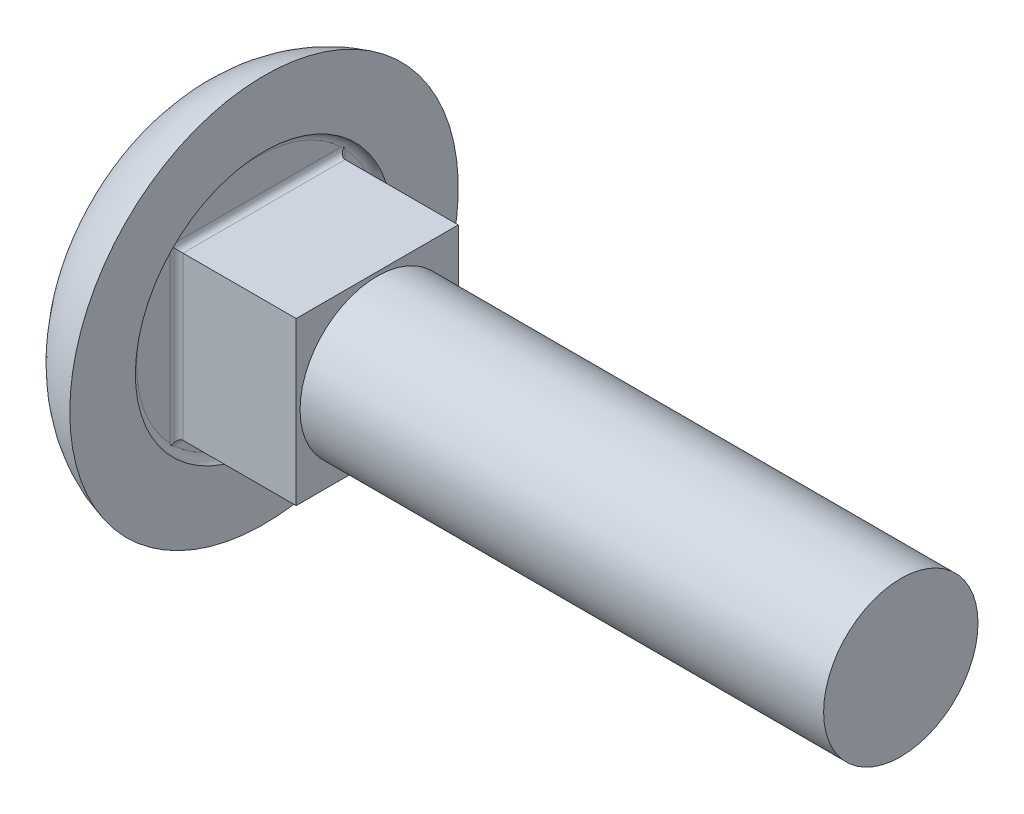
ISO-10303-21;
HEADER;
FILE_DESCRIPTION(('STEP AP214'),'2;1');
FILE_NAME('part.step','',(''),(''),'','','');
FILE_SCHEMA(('AUTOMOTIVE_DESIGN { 1 0 10303 214 1 1 1 1 }'));
ENDSEC;
DATA;
#1=APPLICATION_CONTEXT('core data for automotive mechanical design processes');
#2=APPLICATION_PROTOCOL_DEFINITION('international standard','automotive_design',2000,#1);
#3=PRODUCT_CONTEXT('',#1,'mechanical');
#4=PRODUCT('Part','Part','',(#3));
#5=PRODUCT_RELATED_PRODUCT_CATEGORY('part','',(#4));
#6=PRODUCT_DEFINITION_FORMATION('','',#4);
#7=PRODUCT_DEFINITION_CONTEXT('part definition',#1,'design');
#8=PRODUCT_DEFINITION('design','',#6,#7);
#9=PRODUCT_DEFINITION_SHAPE('','',#8);
#10=(LENGTH_UNIT() NAMED_UNIT(*) SI_UNIT(.MILLI.,.METRE.));
#11=(NAMED_UNIT(*) PLANE_ANGLE_UNIT() SI_UNIT($,.RADIAN.));
#12=(NAMED_UNIT(*) SI_UNIT($,.STERADIAN.) SOLID_ANGLE_UNIT());
#13=UNCERTAINTY_MEASURE_WITH_UNIT(LENGTH_MEASURE(1.E-05),#10,'distance_accuracy_value','');
#14=(GEOMETRIC_REPRESENTATION_CONTEXT(3) GLOBAL_UNCERTAINTY_ASSIGNED_CONTEXT((#13)) GLOBAL_UNIT_ASSIGNED_CONTEXT((#10,
#11,#12)) REPRESENTATION_CONTEXT('',''));
#15=CARTESIAN_POINT('',(0.,0.,0.));
#16=DIRECTION('',(0.,0.,1.));
#17=DIRECTION('',(1.,0.,0.));
#18=AXIS2_PLACEMENT_3D('',#15,#16,#17);
#19=CARTESIAN_POINT('',(3.73,0.,0.));
#20=DIRECTION('',(1.,0.,0.));
#21=DIRECTION('',(0.,0.,-1.));
#22=AXIS2_PLACEMENT_3D('',#19,#20,#21);
#23=PLANE('',#22);
#24=DIRECTION('',(0.,0.,-1.));
#25=VECTOR('',#24,1.);
#26=CARTESIAN_POINT('',(3.73,3.4,-3.15));
#27=LINE('',#26,#25);
#28=CARTESIAN_POINT('',(3.73,3.4,3.2510706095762));
#29=VERTEX_POINT('',#28);
#30=CARTESIAN_POINT('',(3.73,3.4,-3.2510706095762));
#31=VERTEX_POINT('',#30);
#32=EDGE_CURVE('E172',#29,#31,#27,.T.);
#33=ORIENTED_EDGE('',*,*,#32,.T.);
#34=CARTESIAN_POINT('',(3.73,0.,0.));
#35=DIRECTION('',(1.,0.,0.));
#36=DIRECTION('',(0.,0.,-1.));
#37=AXIS2_PLACEMENT_3D('',#34,#35,#36);
#38=CIRCLE('',#37,4.70419601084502);
#39=EDGE_CURVE('E204',#31,#29,#38,.T.);
#40=ORIENTED_EDGE('',*,*,#39,.T.);
#41=EDGE_LOOP('',(#33,#40));
#42=FACE_BOUND('',#41,.T.);
#43=ADVANCED_FACE('F36',(#42),#23,.T.);
#44=DIRECTION('',(0.,1.,0.));
#45=VECTOR('',#44,1.);
#46=CARTESIAN_POINT('',(3.73,3.15,3.4));
#47=LINE('',#46,#45);
#48=CARTESIAN_POINT('',(3.73,-3.2510706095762,3.4));
#49=VERTEX_POINT('',#48);
#50=CARTESIAN_POINT('',(3.73,3.2510706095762,3.4));
#51=VERTEX_POINT('',#50);
#52=EDGE_CURVE('E175',#49,#51,#47,.T.);
#53=ORIENTED_EDGE('',*,*,#52,.T.);
#54=CARTESIAN_POINT('',(3.73,0.,0.));
#55=DIRECTION('',(1.,0.,0.));
#56=DIRECTION('',(0.,0.,-1.));
#57=AXIS2_PLACEMENT_3D('',#54,#55,#56);
#58=CIRCLE('',#57,4.70419601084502);
#59=EDGE_CURVE('E202',#51,#49,#58,.T.);
#60=ORIENTED_EDGE('',*,*,#59,.T.);
#61=EDGE_LOOP('',(#53,#60));
#62=FACE_BOUND('',#61,.T.);
#63=ADVANCED_FACE('F293',(#62),#23,.T.);
#64=DIRECTION('',(0.,0.,1.));
#65=VECTOR('',#64,1.);
#66=CARTESIAN_POINT('',(3.73,-3.4,3.15));
#67=LINE('',#66,#65);
#68=CARTESIAN_POINT('',(3.73,-3.4,-3.2510706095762));
#69=VERTEX_POINT('',#68);
#70=CARTESIAN_POINT('',(3.73,-3.4,3.2510706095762));
#71=VERTEX_POINT('',#70);
#72=EDGE_CURVE('E178',#69,#71,#67,.T.);
#73=ORIENTED_EDGE('',*,*,#72,.T.);
#74=CARTESIAN_POINT('',(3.73,0.,0.));
#75=DIRECTION('',(1.,0.,0.));
#76=DIRECTION('',(0.,0.,-1.));
#77=AXIS2_PLACEMENT_3D('',#74,#75,#76);
#78=CIRCLE('',#77,4.70419601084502);
#79=EDGE_CURVE('E200',#71,#69,#78,.T.);
#80=ORIENTED_EDGE('',*,*,#79,.T.);
#81=EDGE_LOOP('',(#73,#80));
#82=FACE_BOUND('',#81,.T.);
#83=ADVANCED_FACE('F267',(#82),#23,.T.);
#84=CARTESIAN_POINT('',(8.38,-3.15,3.15));
#85=DIRECTION('',(-1.,0.,0.));
#86=DIRECTION('',(0.,0.,1.));
#87=AXIS2_PLACEMENT_3D('',#84,#85,#86);
#88=PLANE('',#87);
#89=DIRECTION('',(0.,0.,-1.));
#90=VECTOR('',#89,1.);
#91=CARTESIAN_POINT('',(8.38,-3.15,3.15));
#92=LINE('',#91,#90);
#93=CARTESIAN_POINT('',(8.38,-3.15,3.15));
#94=VERTEX_POINT('',#93);
#95=CARTESIAN_POINT('',(8.38,-3.15,-3.15));
#96=VERTEX_POINT('',#95);
#97=EDGE_CURVE('E126',#94,#96,#92,.T.);
#98=ORIENTED_EDGE('',*,*,#97,.T.);
#99=DIRECTION('',(0.,1.,0.));
#100=VECTOR('',#99,1.);
#101=CARTESIAN_POINT('',(8.38,-3.15,-3.15));
#102=LINE('',#101,#100);
#103=CARTESIAN_POINT('',(8.38,3.15,-3.15));
#104=VERTEX_POINT('',#103);
#105=EDGE_CURVE('E135',#96,#104,#102,.T.);
#106=ORIENTED_EDGE('',*,*,#105,.T.);
#107=DIRECTION('',(0.,0.,1.));
#108=VECTOR('',#107,1.);
#109=CARTESIAN_POINT('',(8.38,3.15,-3.15));
#110=LINE('',#109,#108);
#111=CARTESIAN_POINT('',(8.38,3.15,3.15));
#112=VERTEX_POINT('',#111);
#113=EDGE_CURVE('E141',#104,#112,#110,.T.);
#114=ORIENTED_EDGE('',*,*,#113,.T.);
#115=DIRECTION('',(0.,-1.,0.));
#116=VECTOR('',#115,1.);
#117=CARTESIAN_POINT('',(8.38,3.15,3.15));
#118=LINE('',#117,#116);
#119=EDGE_CURVE('E147',#112,#94,#118,.T.);
#120=ORIENTED_EDGE('',*,*,#119,.T.);
#121=EDGE_LOOP('',(#98,#106,#114,#120));
#122=FACE_BOUND('',#121,.T.);
#123=CARTESIAN_POINT('',(8.38,0.,0.));
#124=DIRECTION('',(-1.,0.,0.));
#125=DIRECTION('',(0.,0.,1.));
#126=AXIS2_PLACEMENT_3D('',#123,#124,#125);
#127=CIRCLE('',#126,3.);
#128=CARTESIAN_POINT('',(8.38,0.,3.));
#129=VERTEX_POINT('',#128);
#130=EDGE_CURVE('E188',#129,#129,#127,.F.);
#131=ORIENTED_EDGE('',*,*,#130,.F.);
#132=EDGE_LOOP('',(#131));
#133=FACE_BOUND('',#132,.T.);
#134=ADVANCED_FACE('F144',(#122,#133),#88,.F.);
#135=CARTESIAN_POINT('',(5.04748806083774,0.,0.));
#136=DIRECTION('',(-1.,0.,0.));
#137=DIRECTION('',(0.,0.,1.));
#138=AXIS2_PLACEMENT_3D('',#135,#136,#137);
#139=DEGENERATE_TOROIDAL_SURFACE('',#138,3.17844773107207,4.5,.T.);
#140=CARTESIAN_POINT('',(0.806824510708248,0.,0.));
#141=DIRECTION('',(-1.,0.,0.));
#142=DIRECTION('',(0.,0.,1.));
#143=AXIS2_PLACEMENT_3D('',#140,#141,#142);
#144=CIRCLE('',#143,4.68402823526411);
#145=CARTESIAN_POINT('',(0.806824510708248,0.,4.68402823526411));
#146=VERTEX_POINT('',#145);
#147=EDGE_CURVE('E163',#146,#146,#144,.T.);
#148=ORIENTED_EDGE('',*,*,#147,.F.);
#149=EDGE_LOOP('',(#148));
#150=FACE_BOUND('',#149,.T.);
#151=CARTESIAN_POINT('',(3.98,0.,0.));
#152=DIRECTION('',(-1.,0.,0.));
#153=DIRECTION('',(0.,0.,1.));
#154=AXIS2_PLACEMENT_3D('',#151,#152,#153);
#155=CIRCLE('',#154,7.55);
#156=CARTESIAN_POINT('',(3.98,0.,7.55));
#157=VERTEX_POINT('',#156);
#158=EDGE_CURVE('E166',#157,#157,#155,.T.);
#159=ORIENTED_EDGE('',*,*,#158,.T.);
#160=EDGE_LOOP('',(#159));
#161=FACE_BOUND('',#160,.T.);
#162=ADVANCED_FACE('F250',(#150,#161),#139,.T.);
#163=CARTESIAN_POINT('',(3.98,7.55,0.));
#164=DIRECTION('',(-1.,0.,0.));
#165=DIRECTION('',(0.,0.,1.));
#166=AXIS2_PLACEMENT_3D('',#163,#164,#165);
#167=PLANE('',#166);
#168=CARTESIAN_POINT('',(3.98,0.,0.));
#169=DIRECTION('',(1.,0.,0.));
#170=DIRECTION('',(0.,0.,-1.));
#171=AXIS2_PLACEMENT_3D('',#168,#169,#170);
#172=CIRCLE('',#171,5.);
#173=CARTESIAN_POINT('',(3.98,0.,-5.));
#174=VERTEX_POINT('',#173);
#175=EDGE_CURVE('E131',#174,#174,#172,.T.);
#176=ORIENTED_EDGE('',*,*,#175,.F.);
#177=EDGE_LOOP('',(#176));
#178=FACE_BOUND('',#177,.T.);
#179=ORIENTED_EDGE('',*,*,#158,.F.);
#180=EDGE_LOOP('',(#179));
#181=FACE_BOUND('',#180,.T.);
#182=ADVANCED_FACE('F254',(#178,#181),#167,.F.);
#183=CARTESIAN_POINT('',(14.,0.,0.));
#184=DIRECTION('',(-1.,0.,0.));
#185=DIRECTION('',(0.,1.,0.));
#186=AXIS2_PLACEMENT_3D('',#183,#184,#185);
#187=SPHERICAL_SURFACE('',#186,14.);
#188=ORIENTED_EDGE('',*,*,#147,.T.);
#189=EDGE_LOOP('',(#188));
#190=FACE_BOUND('',#189,.T.);
#191=ADVANCED_FACE('F258',(#190),#187,.T.);
#192=DIRECTION('',(0.,-1.,0.));
#193=VECTOR('',#192,1.);
#194=CARTESIAN_POINT('',(3.73,-3.15,-3.4));
#195=LINE('',#194,#193);
#196=CARTESIAN_POINT('',(3.73,3.2510706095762,-3.4));
#197=VERTEX_POINT('',#196);
#198=CARTESIAN_POINT('',(3.73,-3.2510706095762,-3.4));
#199=VERTEX_POINT('',#198);
#200=EDGE_CURVE('E169',#197,#199,#195,.T.);
#201=ORIENTED_EDGE('',*,*,#200,.T.);
#202=CARTESIAN_POINT('',(3.73,0.,0.));
#203=DIRECTION('',(1.,0.,0.));
#204=DIRECTION('',(0.,0.,-1.));
#205=AXIS2_PLACEMENT_3D('',#202,#203,#204);
#206=CIRCLE('',#205,4.70419601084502);
#207=EDGE_CURVE('E198',#199,#197,#206,.T.);
#208=ORIENTED_EDGE('',*,*,#207,.T.);
#209=EDGE_LOOP('',(#201,#208));
#210=FACE_BOUND('',#209,.T.);
#211=ADVANCED_FACE('F262',(#210),#23,.T.);
#212=CARTESIAN_POINT('',(-500000.,-3.15,-3.15));
#213=DIRECTION('',(0.,0.,-1.));
#214=DIRECTION('',(0.,1.,0.));
#215=AXIS2_PLACEMENT_3D('',#212,#213,#214);
#216=PLANE('',#215);
#217=DIRECTION('',(1.,0.,0.));
#218=VECTOR('',#217,1.);
#219=CARTESIAN_POINT('',(-500000.,-3.15,-3.15));
#220=LINE('',#219,#218);
#221=CARTESIAN_POINT('',(3.97999999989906,-3.15,-3.15));
#222=VERTEX_POINT('',#221);
#223=EDGE_CURVE('E121',#222,#96,#220,.T.);
#224=ORIENTED_EDGE('',*,*,#223,.F.);
#225=DIRECTION('',(0.,-1.,0.));
#226=VECTOR('',#225,1.);
#227=CARTESIAN_POINT('',(3.98,3.15,-3.15));
#228=LINE('',#227,#226);
#229=CARTESIAN_POINT('',(3.97999999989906,3.15,-3.15));
#230=VERTEX_POINT('',#229);
#231=EDGE_CURVE('E186',#222,#230,#228,.F.);
#232=ORIENTED_EDGE('',*,*,#231,.T.);
#233=DIRECTION('',(1.,0.,0.));
#234=VECTOR('',#233,1.);
#235=CARTESIAN_POINT('',(-500000.,3.15,-3.15));
#236=LINE('',#235,#234);
#237=EDGE_CURVE('E132',#230,#104,#236,.T.);
#238=ORIENTED_EDGE('',*,*,#237,.T.);
#239=ORIENTED_EDGE('',*,*,#105,.F.);
#240=EDGE_LOOP('',(#224,#232,#238,#239));
#241=FACE_BOUND('',#240,.T.);
#242=ADVANCED_FACE('F136',(#241),#216,.T.);
#243=CARTESIAN_POINT('',(-500000.,3.15,-3.15));
#244=DIRECTION('',(0.,1.,0.));
#245=DIRECTION('',(0.,0.,1.));
#246=AXIS2_PLACEMENT_3D('',#243,#244,#245);
#247=PLANE('',#246);
#248=ORIENTED_EDGE('',*,*,#237,.F.);
#249=DIRECTION('',(0.,0.,-1.));
#250=VECTOR('',#249,1.);
#251=CARTESIAN_POINT('',(3.98,3.15,3.15));
#252=LINE('',#251,#250);
#253=CARTESIAN_POINT('',(3.97999999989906,3.15,3.15));
#254=VERTEX_POINT('',#253);
#255=EDGE_CURVE('E184',#230,#254,#252,.F.);
#256=ORIENTED_EDGE('',*,*,#255,.T.);
#257=DIRECTION('',(1.,0.,0.));
#258=VECTOR('',#257,1.);
#259=CARTESIAN_POINT('',(-500000.,3.15,3.15));
#260=LINE('',#259,#258);
#261=EDGE_CURVE('E157',#254,#112,#260,.T.);
#262=ORIENTED_EDGE('',*,*,#261,.T.);
#263=ORIENTED_EDGE('',*,*,#113,.F.);
#264=EDGE_LOOP('',(#248,#256,#262,#263));
#265=FACE_BOUND('',#264,.T.);
#266=ADVANCED_FACE('F270',(#265),#247,.T.);
#267=CARTESIAN_POINT('',(-500000.,-3.15,3.15));
#268=DIRECTION('',(0.,-1.,0.));
#269=DIRECTION('',(0.,0.,-1.));
#270=AXIS2_PLACEMENT_3D('',#267,#268,#269);
#271=PLANE('',#270);
#272=DIRECTION('',(1.,0.,0.));
#273=VECTOR('',#272,1.);
#274=CARTESIAN_POINT('',(-500000.,-3.15,3.15));
#275=LINE('',#274,#273);
#276=CARTESIAN_POINT('',(3.97999999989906,-3.15,3.15));
#277=VERTEX_POINT('',#276);
#278=EDGE_CURVE('E155',#277,#94,#275,.T.);
#279=ORIENTED_EDGE('',*,*,#278,.F.);
#280=DIRECTION('',(0.,0.,1.));
#281=VECTOR('',#280,1.);
#282=CARTESIAN_POINT('',(3.98,-3.15,-3.15));
#283=LINE('',#282,#281);
#284=EDGE_CURVE('E128',#277,#222,#283,.F.);
#285=ORIENTED_EDGE('',*,*,#284,.T.);
#286=ORIENTED_EDGE('',*,*,#223,.T.);
#287=ORIENTED_EDGE('',*,*,#97,.F.);
#288=EDGE_LOOP('',(#279,#285,#286,#287));
#289=FACE_BOUND('',#288,.T.);
#290=ADVANCED_FACE('F124',(#289),#271,.T.);
#291=CARTESIAN_POINT('',(-500000.,3.15,3.15));
#292=DIRECTION('',(0.,0.,1.));
#293=DIRECTION('',(0.,-1.,0.));
#294=AXIS2_PLACEMENT_3D('',#291,#292,#293);
#295=PLANE('',#294);
#296=ORIENTED_EDGE('',*,*,#261,.F.);
#297=DIRECTION('',(0.,1.,0.));
#298=VECTOR('',#297,1.);
#299=CARTESIAN_POINT('',(3.98,-3.15,3.15));
#300=LINE('',#299,#298);
#301=EDGE_CURVE('E182',#254,#277,#300,.F.);
#302=ORIENTED_EDGE('',*,*,#301,.T.);
#303=ORIENTED_EDGE('',*,*,#278,.T.);
#304=ORIENTED_EDGE('',*,*,#119,.F.);
#305=EDGE_LOOP('',(#296,#302,#303,#304));
#306=FACE_BOUND('',#305,.T.);
#307=ADVANCED_FACE('F221',(#306),#295,.T.);
#308=CARTESIAN_POINT('',(3.98,3.4,0.));
#309=DIRECTION('',(0.,0.,1.));
#310=DIRECTION('',(0.,-1.,0.));
#311=AXIS2_PLACEMENT_3D('',#308,#309,#310);
#312=CYLINDRICAL_SURFACE('',#311,0.25);
#313=ORIENTED_EDGE('',*,*,#32,.F.);
#314=CARTESIAN_POINT('',(3.73346539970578,3.35851878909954,3.35851878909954));
#315=CARTESIAN_POINT('',(3.7312390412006,3.37200839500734,3.32410990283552));
#316=CARTESIAN_POINT('',(3.73008543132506,3.38533158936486,3.28961869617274));
#317=CARTESIAN_POINT('',(3.73000147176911,3.39899249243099,3.25372043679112));
#318=CARTESIAN_POINT('',(3.7299999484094,3.39949636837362,3.2523955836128));
#319=CARTESIAN_POINT('',(3.73,3.4,3.2510706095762));
#320=B_SPLINE_CURVE_WITH_KNOTS('',3,(#314,#315,#316,#317,#318,#319),.UNSPECIFIED.,.F.,.F.,(4,2,
4),(0.,0.110978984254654,0.115231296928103),.UNSPECIFIED.);
#321=CARTESIAN_POINT('',(3.73346539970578,3.35851878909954,3.35851878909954));
#322=VERTEX_POINT('',#321);
#323=EDGE_CURVE('E212',#29,#322,#320,.F.);
#324=ORIENTED_EDGE('',*,*,#323,.T.);
#325=CARTESIAN_POINT('',(3.98,3.4,3.4));
#326=DIRECTION('',(0.,-0.707106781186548,0.707106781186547));
#327=DIRECTION('',(0.,0.707106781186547,0.707106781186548));
#328=AXIS2_PLACEMENT_3D('',#325,#326,#327);
#329=ELLIPSE('',#328,0.353553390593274,0.25);
#330=EDGE_CURVE('E150',#254,#322,#329,.F.);
#331=ORIENTED_EDGE('',*,*,#330,.F.);
#332=ORIENTED_EDGE('',*,*,#255,.F.);
#333=CARTESIAN_POINT('',(3.98,3.4,-3.4));
#334=DIRECTION('',(0.,0.707106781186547,0.707106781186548));
#335=DIRECTION('',(0.,0.707106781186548,-0.707106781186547));
#336=AXIS2_PLACEMENT_3D('',#333,#334,#335);
#337=ELLIPSE('',#336,0.353553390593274,0.25);
#338=CARTESIAN_POINT('',(3.73346539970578,3.35851878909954,-3.35851878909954));
#339=VERTEX_POINT('',#338);
#340=EDGE_CURVE('E148',#339,#230,#337,.T.);
#341=ORIENTED_EDGE('',*,*,#340,.F.);
#342=CARTESIAN_POINT('',(3.73346539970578,3.35851878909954,-3.35851878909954));
#343=CARTESIAN_POINT('',(3.7312390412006,3.37200839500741,-3.32410990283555));
#344=CARTESIAN_POINT('',(3.73008543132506,3.38533158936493,-3.28961869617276));
#345=CARTESIAN_POINT('',(3.73000147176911,3.39899249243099,-3.25372043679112));
#346=CARTESIAN_POINT('',(3.7299999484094,3.39949636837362,-3.2523955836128));
#347=CARTESIAN_POINT('',(3.73,3.4,-3.2510706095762));
#348=B_SPLINE_CURVE_WITH_KNOTS('',3,(#342,#343,#344,#345,#346,#347),.UNSPECIFIED.,.F.,.F.,(4,2,
4),(0.,0.110978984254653,0.115231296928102),.UNSPECIFIED.);
#349=EDGE_CURVE('E207',#339,#31,#348,.T.);
#350=ORIENTED_EDGE('',*,*,#349,.T.);
#351=EDGE_LOOP('',(#313,#324,#331,#332,#341,#350));
#352=FACE_BOUND('',#351,.T.);
#353=ADVANCED_FACE('F217',(#352),#312,.F.);
#354=CARTESIAN_POINT('',(3.98,0.,-3.4));
#355=DIRECTION('',(0.,1.,0.));
#356=DIRECTION('',(0.,0.,1.));
#357=AXIS2_PLACEMENT_3D('',#354,#355,#356);
#358=CYLINDRICAL_SURFACE('',#357,0.25);
#359=CARTESIAN_POINT('',(3.98,-3.4,-3.4));
#360=DIRECTION('',(0.,0.707106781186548,-0.707106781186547));
#361=DIRECTION('',(0.,0.707106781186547,0.707106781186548));
#362=AXIS2_PLACEMENT_3D('',#359,#360,#361);
#363=ELLIPSE('',#362,0.353553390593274,0.25);
#364=CARTESIAN_POINT('',(3.73346539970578,-3.35851878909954,-3.35851878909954));
#365=VERTEX_POINT('',#364);
#366=EDGE_CURVE('E191',#365,#222,#363,.T.);
#367=ORIENTED_EDGE('',*,*,#366,.F.);
#368=CARTESIAN_POINT('',(3.73346539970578,-3.35851878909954,-3.35851878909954));
#369=CARTESIAN_POINT('',(3.7312390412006,-3.32410990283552,-3.37200839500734));
#370=CARTESIAN_POINT('',(3.73008543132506,-3.28961869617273,-3.38533158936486));
#371=CARTESIAN_POINT('',(3.73000147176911,-3.25372043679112,-3.39899249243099));
#372=CARTESIAN_POINT('',(3.7299999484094,-3.25239558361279,-3.39949636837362));
#373=CARTESIAN_POINT('',(3.73,-3.2510706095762,-3.4));
#374=B_SPLINE_CURVE_WITH_KNOTS('',3,(#368,#369,#370,#371,#372,#373),.UNSPECIFIED.,.F.,.F.,(4,2,
4),(0.,0.110978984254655,0.115231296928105),.UNSPECIFIED.);
#375=EDGE_CURVE('E11',#365,#199,#374,.T.);
#376=ORIENTED_EDGE('',*,*,#375,.T.);
#377=ORIENTED_EDGE('',*,*,#200,.F.);
#378=CARTESIAN_POINT('',(3.73346539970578,3.35851878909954,-3.35851878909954));
#379=CARTESIAN_POINT('',(3.7312390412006,3.32410990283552,-3.37200839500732));
#380=CARTESIAN_POINT('',(3.73008543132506,3.28961869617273,-3.38533158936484));
#381=CARTESIAN_POINT('',(3.73000147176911,3.25372043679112,-3.39899249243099));
#382=CARTESIAN_POINT('',(3.7299999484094,3.2523955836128,-3.39949636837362));
#383=CARTESIAN_POINT('',(3.73,3.2510706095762,-3.4));
#384=B_SPLINE_CURVE_WITH_KNOTS('',3,(#378,#379,#380,#381,#382,#383),.UNSPECIFIED.,.F.,.F.,(4,2,
4),(0.,0.110978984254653,0.115231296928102),.UNSPECIFIED.);
#385=EDGE_CURVE('E49',#197,#339,#384,.F.);
#386=ORIENTED_EDGE('',*,*,#385,.T.);
#387=ORIENTED_EDGE('',*,*,#340,.T.);
#388=ORIENTED_EDGE('',*,*,#231,.F.);
#389=EDGE_LOOP('',(#367,#376,#377,#386,#387,#388));
#390=FACE_BOUND('',#389,.T.);
#391=ADVANCED_FACE('F220',(#390),#358,.F.);
#392=CARTESIAN_POINT('',(3.98,0.,3.4));
#393=DIRECTION('',(0.,-1.,0.));
#394=DIRECTION('',(0.,0.,-1.));
#395=AXIS2_PLACEMENT_3D('',#392,#393,#394);
#396=CYLINDRICAL_SURFACE('',#395,0.25);
#397=ORIENTED_EDGE('',*,*,#330,.T.);
#398=CARTESIAN_POINT('',(3.73346539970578,3.35851878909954,3.35851878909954));
#399=CARTESIAN_POINT('',(3.7312390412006,3.32410990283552,3.37200839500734));
#400=CARTESIAN_POINT('',(3.73008543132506,3.28961869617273,3.38533158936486));
#401=CARTESIAN_POINT('',(3.73000147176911,3.25372043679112,3.39899249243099));
#402=CARTESIAN_POINT('',(3.7299999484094,3.25239558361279,3.39949636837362));
#403=CARTESIAN_POINT('',(3.73,3.2510706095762,3.4));
#404=B_SPLINE_CURVE_WITH_KNOTS('',3,(#398,#399,#400,#401,#402,#403),.UNSPECIFIED.,.F.,.F.,(4,2,
4),(0.,0.110978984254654,0.115231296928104),.UNSPECIFIED.);
#405=EDGE_CURVE('E306',#322,#51,#404,.T.);
#406=ORIENTED_EDGE('',*,*,#405,.T.);
#407=ORIENTED_EDGE('',*,*,#52,.F.);
#408=CARTESIAN_POINT('',(3.73346539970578,-3.35851878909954,3.35851878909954));
#409=CARTESIAN_POINT('',(3.7312390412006,-3.32410990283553,3.37200839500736));
#410=CARTESIAN_POINT('',(3.73008543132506,-3.28961869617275,3.38533158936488));
#411=CARTESIAN_POINT('',(3.73000147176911,-3.25372043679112,3.39899249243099));
#412=CARTESIAN_POINT('',(3.7299999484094,-3.2523955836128,3.39949636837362));
#413=CARTESIAN_POINT('',(3.73,-3.25107060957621,3.4));
#414=B_SPLINE_CURVE_WITH_KNOTS('',3,(#408,#409,#410,#411,#412,#413),.UNSPECIFIED.,.F.,.F.,(4,2,
4),(0.,0.110978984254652,0.115231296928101),.UNSPECIFIED.);
#415=CARTESIAN_POINT('',(3.73346539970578,-3.35851878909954,3.35851878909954));
#416=VERTEX_POINT('',#415);
#417=EDGE_CURVE('E64',#49,#416,#414,.F.);
#418=ORIENTED_EDGE('',*,*,#417,.T.);
#419=CARTESIAN_POINT('',(3.98,-3.4,3.4));
#420=DIRECTION('',(0.,-0.707106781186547,-0.707106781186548));
#421=DIRECTION('',(0.,-0.707106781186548,0.707106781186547));
#422=AXIS2_PLACEMENT_3D('',#419,#420,#421);
#423=ELLIPSE('',#422,0.353553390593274,0.25);
#424=EDGE_CURVE('E189',#277,#416,#423,.F.);
#425=ORIENTED_EDGE('',*,*,#424,.F.);
#426=ORIENTED_EDGE('',*,*,#301,.F.);
#427=EDGE_LOOP('',(#397,#406,#407,#418,#425,#426));
#428=FACE_BOUND('',#427,.T.);
#429=ADVANCED_FACE('F227',(#428),#396,.F.);
#430=CARTESIAN_POINT('',(3.98,-3.4,0.));
#431=DIRECTION('',(0.,0.,-1.));
#432=DIRECTION('',(-1.,0.,0.));
#433=AXIS2_PLACEMENT_3D('',#430,#431,#432);
#434=CYLINDRICAL_SURFACE('',#433,0.25);
#435=ORIENTED_EDGE('',*,*,#424,.T.);
#436=CARTESIAN_POINT('',(3.73346539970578,-3.35851878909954,3.35851878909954));
#437=CARTESIAN_POINT('',(3.7312390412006,-3.37200839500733,3.32410990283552));
#438=CARTESIAN_POINT('',(3.73008543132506,-3.38533158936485,3.28961869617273));
#439=CARTESIAN_POINT('',(3.73000147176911,-3.39899249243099,3.25372043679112));
#440=CARTESIAN_POINT('',(3.7299999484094,-3.39949636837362,3.25239558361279));
#441=CARTESIAN_POINT('',(3.73,-3.4,3.2510706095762));
#442=B_SPLINE_CURVE_WITH_KNOTS('',3,(#436,#437,#438,#439,#440,#441),.UNSPECIFIED.,.F.,.F.,(4,2,
4),(0.,0.110978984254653,0.115231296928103),.UNSPECIFIED.);
#443=EDGE_CURVE('E236',#416,#71,#442,.T.);
#444=ORIENTED_EDGE('',*,*,#443,.T.);
#445=ORIENTED_EDGE('',*,*,#72,.F.);
#446=CARTESIAN_POINT('',(3.73346539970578,-3.35851878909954,-3.35851878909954));
#447=CARTESIAN_POINT('',(3.7312390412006,-3.37200839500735,-3.32410990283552));
#448=CARTESIAN_POINT('',(3.73008543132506,-3.38533158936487,-3.28961869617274));
#449=CARTESIAN_POINT('',(3.73000147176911,-3.39899249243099,-3.25372043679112));
#450=CARTESIAN_POINT('',(3.7299999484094,-3.39949636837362,-3.25239558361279));
#451=CARTESIAN_POINT('',(3.73,-3.4,-3.2510706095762));
#452=B_SPLINE_CURVE_WITH_KNOTS('',3,(#446,#447,#448,#449,#450,#451),.UNSPECIFIED.,.F.,.F.,(4,2,
4),(0.,0.110978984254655,0.115231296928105),.UNSPECIFIED.);
#453=EDGE_CURVE('E56',#69,#365,#452,.F.);
#454=ORIENTED_EDGE('',*,*,#453,.T.);
#455=ORIENTED_EDGE('',*,*,#366,.T.);
#456=ORIENTED_EDGE('',*,*,#284,.F.);
#457=EDGE_LOOP('',(#435,#444,#445,#454,#455,#456));
#458=FACE_BOUND('',#457,.T.);
#459=ADVANCED_FACE('F245',(#458),#434,.F.);
#460=CARTESIAN_POINT('',(28.73,0.,0.));
#461=DIRECTION('',(-1.,0.,0.));
#462=DIRECTION('',(0.,0.,1.));
#463=AXIS2_PLACEMENT_3D('',#460,#461,#462);
#464=CYLINDRICAL_SURFACE('',#463,3.);
#465=CARTESIAN_POINT('',(28.73,0.,0.));
#466=DIRECTION('',(1.,0.,0.));
#467=DIRECTION('',(0.,0.,-1.));
#468=AXIS2_PLACEMENT_3D('',#465,#466,#467);
#469=CIRCLE('',#468,3.);
#470=CARTESIAN_POINT('',(28.73,0.,-3.));
#471=VERTEX_POINT('',#470);
#472=EDGE_CURVE('E192',#471,#471,#469,.T.);
#473=ORIENTED_EDGE('',*,*,#472,.F.);
#474=EDGE_LOOP('',(#473));
#475=FACE_BOUND('',#474,.T.);
#476=ORIENTED_EDGE('',*,*,#130,.T.);
#477=EDGE_LOOP('',(#476));
#478=FACE_BOUND('',#477,.T.);
#479=ADVANCED_FACE('F249',(#475,#478),#464,.T.);
#480=CARTESIAN_POINT('',(28.73,0.,0.));
#481=DIRECTION('',(1.,0.,0.));
#482=DIRECTION('',(0.,0.,-1.));
#483=AXIS2_PLACEMENT_3D('',#480,#481,#482);
#484=PLANE('',#483);
#485=ORIENTED_EDGE('',*,*,#472,.T.);
#486=EDGE_LOOP('',(#485));
#487=FACE_BOUND('',#486,.T.);
#488=ADVANCED_FACE('F283',(#487),#484,.T.);
#489=CARTESIAN_POINT('',(4.03,0.,0.));
#490=DIRECTION('',(-1.,0.,0.));
#491=DIRECTION('',(0.,0.,1.));
#492=AXIS2_PLACEMENT_3D('',#489,#490,#491);
#493=TOROIDAL_SURFACE('',#492,4.70419601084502,0.3);
#494=ORIENTED_EDGE('',*,*,#175,.T.);
#495=EDGE_LOOP('',(#494));
#496=FACE_BOUND('',#495,.T.);
#497=ORIENTED_EDGE('',*,*,#323,.F.);
#498=ORIENTED_EDGE('',*,*,#39,.F.);
#499=ORIENTED_EDGE('',*,*,#349,.F.);
#500=ORIENTED_EDGE('',*,*,#385,.F.);
#501=ORIENTED_EDGE('',*,*,#207,.F.);
#502=ORIENTED_EDGE('',*,*,#375,.F.);
#503=ORIENTED_EDGE('',*,*,#453,.F.);
#504=ORIENTED_EDGE('',*,*,#79,.F.);
#505=ORIENTED_EDGE('',*,*,#443,.F.);
#506=ORIENTED_EDGE('',*,*,#417,.F.);
#507=ORIENTED_EDGE('',*,*,#59,.F.);
#508=ORIENTED_EDGE('',*,*,#405,.F.);
#509=EDGE_LOOP('',(#497,#498,#499,#500,#501,#502,#503,#504,#505,#506,#507,#508));
#510=FACE_BOUND('',#509,.T.);
#511=ADVANCED_FACE('F38',(#496,#510),#493,.F.);
#512=CLOSED_SHELL('',(#43,#63,#83,#134,#162,#182,#191,#211,#242,#266,#290,#307,#353,#391,#429,
#459,#479,#488,#511));
#513=MANIFOLD_SOLID_BREP('B2',#512);
#514=ADVANCED_BREP_SHAPE_REPRESENTATION('',(#18,#513),#14);
#515=SHAPE_DEFINITION_REPRESENTATION(#9,#514);
ENDSEC;
END-ISO-10303-21;
